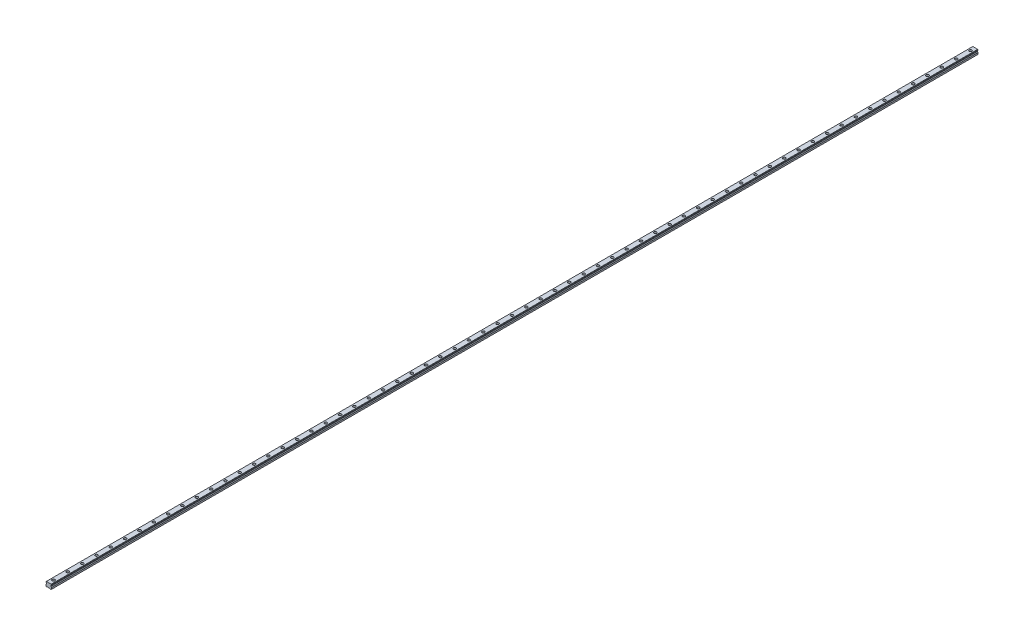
from build123d import *

# Parameters (mm, degrees)
SKETCH1_W           = 23
SKETCH1_H           = 19.2
BOSS_EXTRUDE1_DEPTH = 1940
CUT_EXTRUDE1_DEPTH  = 3881.064547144
CHAMFER1_SIZE       = 1.25
FILLET1_R           = 1.25
CUT_EXTRUDE2_DEPTH  = 3881.064547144
SKETCH4_R           = 5.5
SKETCH4_R_2         = 3.5
CUT_EXTRUDE3_DEPTH  = 9
SKETCH4_2_R         = 3.5
CUT_EXTRUDE4_DEPTH  = 1941.129091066
LPATTERN1_COUNT     = 65
LPATTERN1_PITCH     = 60


with BuildPart() as part:
    # Sketch1 → Boss-Extrude1 (new, symmetric)
    with BuildSketch(Plane.XY):
        with Locations((0, 9.6)):
            Rectangle(SKETCH1_W, SKETCH1_H)
    extrude(amount=BOSS_EXTRUDE1_DEPTH, both=True)

    # Sketch2 → Cut-Extrude1 (cut, through all)
    with BuildSketch(Plane.XY.offset(1940)):
        Polygon((-11.5, 16.7), (-11.5, 7.95), (-8.583333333, 10.866666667), (-8.583333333, 13.783333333), align=None)
        Polygon((8.583333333, 13.783333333), (11.5, 16.7), (11.5, 7.95), (8.583333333, 10.866666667), align=None)
    extrude(amount=-CUT_EXTRUDE1_DEPTH, mode=Mode.SUBTRACT)

    # Chamfer1
    chamfer1_edges = [part.edges().sort_by_distance(p)[0] for p in [
        (-11.5, 19.2, 0),
        (11.5, 19.2, 0),
        (11.5, 0, 0),
        (-11.5, 0, 0),
    ]]
    chamfer(chamfer1_edges, length=CHAMFER1_SIZE)

    # Fillet1
    fillet1_edges = [part.edges().sort_by_distance(p)[0] for p in [
        (-8.583333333, 13.783333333, 0),
        (-8.583333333, 10.866666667, 0),
        (8.583333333, 10.866666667, 0),
        (8.583333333, 13.783333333, 0),
    ]]
    fillet(fillet1_edges, radius=FILLET1_R)

    # Sketch3 → Cut-Extrude2 (cut, through all)
    with BuildSketch(Plane.XY.offset(1940)):
        Polygon((-7, 0), (-5.75, 1.25), (5.75, 1.25), (7, 0), align=None)
    extrude(amount=-CUT_EXTRUDE2_DEPTH, mode=Mode.SUBTRACT)

    # Sketch4 → Cut-Extrude3 (cut)
    with BuildSketch(Plane(origin=(0, 19.2, 0), x_dir=(1, 0, 0), z_dir=(0, 1, 0))):
        with Locations(Location((0, -1920, 0), (0, 0, 270))):
            Circle(SKETCH4_R)
        with Locations(Location((0, -1920, 0), (0, 0, 270))):
            Circle(SKETCH4_R_2, mode=Mode.SUBTRACT)
    cut_extrude3 = extrude(amount=-CUT_EXTRUDE3_DEPTH, mode=Mode.SUBTRACT)

    # Sketch4_2 → Cut-Extrude4 (cut, through all)
    with BuildSketch(Plane(origin=(0, 19.2, 0), x_dir=(1, 0, 0), z_dir=(0, 1, 0))):
        with Locations(Location((0, -1920, 0), (0, 0, 270))):
            Circle(SKETCH4_2_R)
    cut_extrude4 = extrude(amount=-CUT_EXTRUDE4_DEPTH, mode=Mode.SUBTRACT)

    # LPattern1: Cut-Extrude3, Cut-Extrude4 ×65
    with Locations(*[(0, 0, -i * LPATTERN1_PITCH) for i in range(1, LPATTERN1_COUNT)]):
        add(cut_extrude3, mode=Mode.SUBTRACT)
        add(cut_extrude4, mode=Mode.SUBTRACT)


solid = part.part
